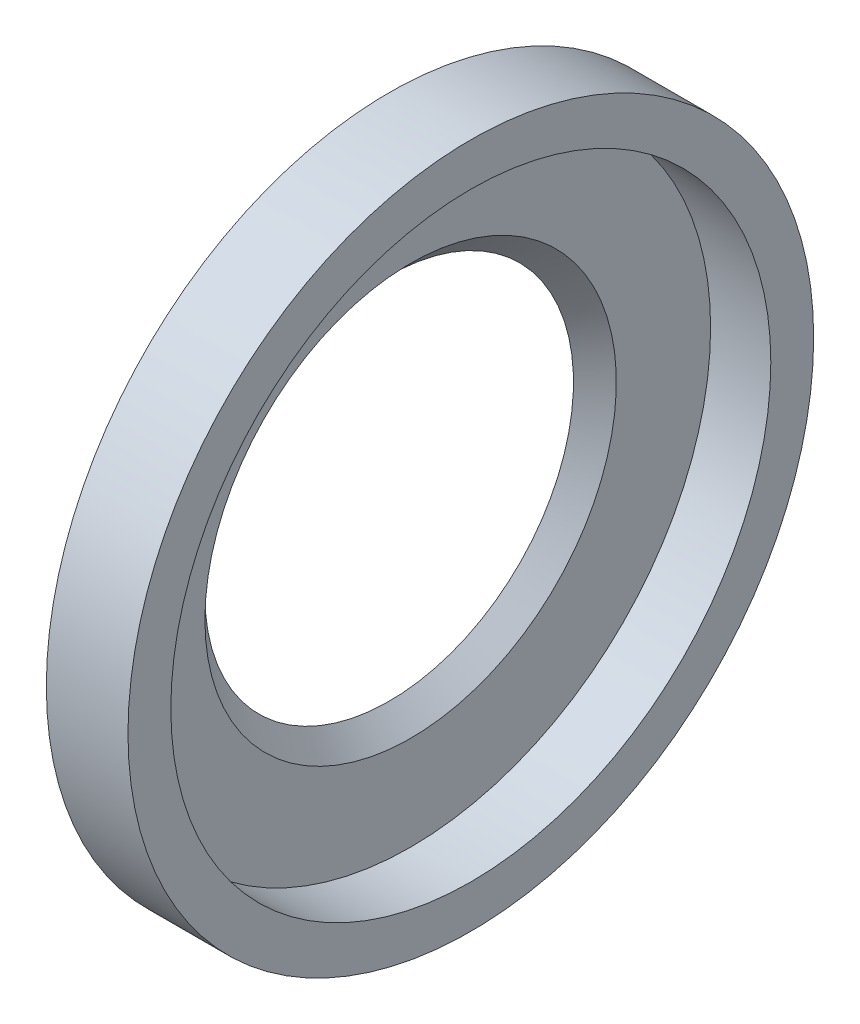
from build123d import *


with BuildPart() as part:
    # Sketch1 → Revolve1 (revolve)
    with BuildSketch(Plane.XY, mode=Mode.PRIVATE) as revolve1_sk:
        Polygon((0, 6.8267), (0, 12.7), (3.0239, 12.7), (3.0239, 11.1125), (0.79375, 11.1125), (0.79375, 7.62045), align=None)
    revolve(revolve1_sk.sketch.rotate(Axis((0, 0, 0), (1, 0, 0)), 90), axis=Axis((0, 0, 0), (1, 0, 0)))


solid = part.part
